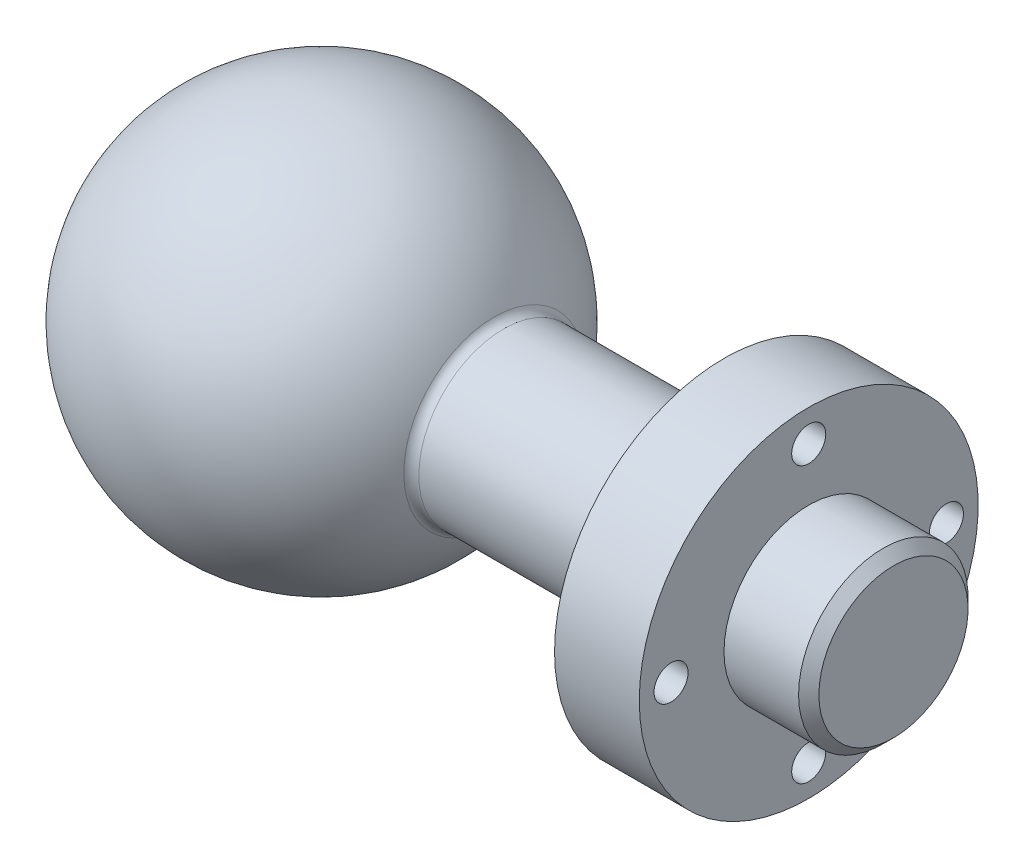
ISO-10303-21;
HEADER;
FILE_DESCRIPTION(('STEP AP214'),'2;1');
FILE_NAME('part.step','',(''),(''),'','','');
FILE_SCHEMA(('AUTOMOTIVE_DESIGN { 1 0 10303 214 1 1 1 1 }'));
ENDSEC;
DATA;
#1=APPLICATION_CONTEXT('core data for automotive mechanical design processes');
#2=APPLICATION_PROTOCOL_DEFINITION('international standard','automotive_design',2000,#1);
#3=PRODUCT_CONTEXT('',#1,'mechanical');
#4=PRODUCT('Part','Part','',(#3));
#5=PRODUCT_RELATED_PRODUCT_CATEGORY('part','',(#4));
#6=PRODUCT_DEFINITION_FORMATION('','',#4);
#7=PRODUCT_DEFINITION_CONTEXT('part definition',#1,'design');
#8=PRODUCT_DEFINITION('design','',#6,#7);
#9=PRODUCT_DEFINITION_SHAPE('','',#8);
#10=(LENGTH_UNIT() NAMED_UNIT(*) SI_UNIT(.MILLI.,.METRE.));
#11=(NAMED_UNIT(*) PLANE_ANGLE_UNIT() SI_UNIT($,.RADIAN.));
#12=(NAMED_UNIT(*) SI_UNIT($,.STERADIAN.) SOLID_ANGLE_UNIT());
#13=UNCERTAINTY_MEASURE_WITH_UNIT(LENGTH_MEASURE(1.E-05),#10,'distance_accuracy_value','');
#14=(GEOMETRIC_REPRESENTATION_CONTEXT(3) GLOBAL_UNCERTAINTY_ASSIGNED_CONTEXT((#13)) GLOBAL_UNIT_ASSIGNED_CONTEXT((#10,
#11,#12)) REPRESENTATION_CONTEXT('',''));
#15=CARTESIAN_POINT('',(0.,0.,0.));
#16=DIRECTION('',(0.,0.,1.));
#17=DIRECTION('',(1.,0.,0.));
#18=AXIS2_PLACEMENT_3D('',#15,#16,#17);
#19=CARTESIAN_POINT('',(0.,0.,0.));
#20=DIRECTION('',(-1.,0.,0.));
#21=DIRECTION('',(0.,1.,0.));
#22=AXIS2_PLACEMENT_3D('',#19,#20,#21);
#23=SPHERICAL_SURFACE('',#22,29.21);
#24=CARTESIAN_POINT('',(25.8765078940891,0.,0.));
#25=DIRECTION('',(-1.,0.,0.));
#26=DIRECTION('',(0.,0.,1.));
#27=AXIS2_PLACEMENT_3D('',#24,#25,#26);
#28=CIRCLE('',#27,13.5510309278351);
#29=CARTESIAN_POINT('',(25.8765078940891,0.,13.5510309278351));
#30=VERTEX_POINT('',#29);
#31=EDGE_CURVE('E46',#30,#30,#28,.T.);
#32=ORIENTED_EDGE('',*,*,#31,.T.);
#33=EDGE_LOOP('',(#32));
#34=FACE_BOUND('',#33,.T.);
#35=ADVANCED_FACE('F35',(#34),#23,.T.);
#36=CARTESIAN_POINT('',(85.725,12.7,0.));
#37=DIRECTION('',(-1.,0.,0.));
#38=DIRECTION('',(0.,0.,1.));
#39=AXIS2_PLACEMENT_3D('',#36,#37,#38);
#40=PLANE('',#39);
#41=CARTESIAN_POINT('',(85.725,0.,0.));
#42=DIRECTION('',(-1.,0.,0.));
#43=DIRECTION('',(0.,0.,1.));
#44=AXIS2_PLACEMENT_3D('',#41,#42,#43);
#45=CIRCLE('',#44,11.176);
#46=CARTESIAN_POINT('',(85.725,0.,11.176));
#47=VERTEX_POINT('',#46);
#48=EDGE_CURVE('E10',#47,#47,#45,.F.);
#49=ORIENTED_EDGE('',*,*,#48,.T.);
#50=EDGE_LOOP('',(#49));
#51=FACE_BOUND('',#50,.T.);
#52=ADVANCED_FACE('F114',(#51),#40,.F.);
#53=CARTESIAN_POINT('',(-88.99,0.,0.));
#54=DIRECTION('',(-1.,0.,0.));
#55=DIRECTION('',(0.,0.,1.));
#56=AXIS2_PLACEMENT_3D('',#53,#54,#55);
#57=CYLINDRICAL_SURFACE('',#56,12.7);
#58=CARTESIAN_POINT('',(84.201,0.,0.));
#59=DIRECTION('',(-1.,0.,0.));
#60=DIRECTION('',(0.,0.,1.));
#61=AXIS2_PLACEMENT_3D('',#58,#59,#60);
#62=CIRCLE('',#61,12.7);
#63=CARTESIAN_POINT('',(84.201,0.,12.7));
#64=VERTEX_POINT('',#63);
#65=EDGE_CURVE('E42',#64,#64,#62,.T.);
#66=ORIENTED_EDGE('',*,*,#65,.T.);
#67=EDGE_LOOP('',(#66));
#68=FACE_BOUND('',#67,.T.);
#69=CARTESIAN_POINT('',(73.025,0.,0.));
#70=DIRECTION('',(-1.,0.,0.));
#71=DIRECTION('',(0.,0.,1.));
#72=AXIS2_PLACEMENT_3D('',#69,#70,#71);
#73=CIRCLE('',#72,12.7);
#74=CARTESIAN_POINT('',(73.025,0.,12.7));
#75=VERTEX_POINT('',#74);
#76=EDGE_CURVE('E61',#75,#75,#73,.T.);
#77=ORIENTED_EDGE('',*,*,#76,.F.);
#78=EDGE_LOOP('',(#77));
#79=FACE_BOUND('',#78,.T.);
#80=ADVANCED_FACE('F101',(#68,#79),#57,.T.);
#81=CARTESIAN_POINT('',(73.025,25.4,0.));
#82=DIRECTION('',(-1.,0.,0.));
#83=DIRECTION('',(0.,0.,1.));
#84=AXIS2_PLACEMENT_3D('',#81,#82,#83);
#85=PLANE('',#84);
#86=CARTESIAN_POINT('',(73.025,0.,20.6375));
#87=DIRECTION('',(1.,0.,0.));
#88=DIRECTION('',(0.,0.,-1.));
#89=AXIS2_PLACEMENT_3D('',#86,#87,#88);
#90=CIRCLE('',#89,2.55269999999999);
#91=CARTESIAN_POINT('',(73.025,0.,18.0848));
#92=VERTEX_POINT('',#91);
#93=EDGE_CURVE('E91',#92,#92,#90,.T.);
#94=ORIENTED_EDGE('',*,*,#93,.F.);
#95=EDGE_LOOP('',(#94));
#96=FACE_BOUND('',#95,.T.);
#97=CARTESIAN_POINT('',(73.025,20.6375,0.));
#98=DIRECTION('',(1.,0.,0.));
#99=DIRECTION('',(0.,0.,-1.));
#100=AXIS2_PLACEMENT_3D('',#97,#98,#99);
#101=CIRCLE('',#100,2.55269999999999);
#102=CARTESIAN_POINT('',(73.025,20.6375,-2.55269999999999));
#103=VERTEX_POINT('',#102);
#104=EDGE_CURVE('E85',#103,#103,#101,.T.);
#105=ORIENTED_EDGE('',*,*,#104,.F.);
#106=EDGE_LOOP('',(#105));
#107=FACE_BOUND('',#106,.T.);
#108=CARTESIAN_POINT('',(73.025,0.,-20.6375));
#109=DIRECTION('',(1.,0.,0.));
#110=DIRECTION('',(0.,0.,-1.));
#111=AXIS2_PLACEMENT_3D('',#108,#109,#110);
#112=CIRCLE('',#111,2.55269999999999);
#113=CARTESIAN_POINT('',(73.025,0.,-23.1902));
#114=VERTEX_POINT('',#113);
#115=EDGE_CURVE('E79',#114,#114,#112,.T.);
#116=ORIENTED_EDGE('',*,*,#115,.F.);
#117=EDGE_LOOP('',(#116));
#118=FACE_BOUND('',#117,.T.);
#119=CARTESIAN_POINT('',(73.025,-20.6375,0.));
#120=DIRECTION('',(1.,0.,0.));
#121=DIRECTION('',(0.,0.,-1.));
#122=AXIS2_PLACEMENT_3D('',#119,#120,#121);
#123=CIRCLE('',#122,2.55269999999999);
#124=CARTESIAN_POINT('',(73.025,-20.6375,-2.55269999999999));
#125=VERTEX_POINT('',#124);
#126=EDGE_CURVE('E73',#125,#125,#123,.T.);
#127=ORIENTED_EDGE('',*,*,#126,.F.);
#128=EDGE_LOOP('',(#127));
#129=FACE_BOUND('',#128,.T.);
#130=CARTESIAN_POINT('',(73.025,0.,0.));
#131=DIRECTION('',(-1.,0.,0.));
#132=DIRECTION('',(0.,0.,1.));
#133=AXIS2_PLACEMENT_3D('',#130,#131,#132);
#134=CIRCLE('',#133,25.4);
#135=CARTESIAN_POINT('',(73.025,0.,25.4));
#136=VERTEX_POINT('',#135);
#137=EDGE_CURVE('E64',#136,#136,#134,.T.);
#138=ORIENTED_EDGE('',*,*,#137,.F.);
#139=EDGE_LOOP('',(#138));
#140=FACE_BOUND('',#139,.T.);
#141=ORIENTED_EDGE('',*,*,#76,.T.);
#142=EDGE_LOOP('',(#141));
#143=FACE_BOUND('',#142,.T.);
#144=ADVANCED_FACE('F97',(#96,#107,#118,#129,#140,#143),#85,.F.);
#145=CARTESIAN_POINT('',(-88.99,0.,0.));
#146=DIRECTION('',(-1.,0.,0.));
#147=DIRECTION('',(0.,0.,1.));
#148=AXIS2_PLACEMENT_3D('',#145,#146,#147);
#149=CYLINDRICAL_SURFACE('',#148,25.4);
#150=CARTESIAN_POINT('',(60.325,0.,0.));
#151=DIRECTION('',(-1.,0.,0.));
#152=DIRECTION('',(0.,0.,1.));
#153=AXIS2_PLACEMENT_3D('',#150,#151,#152);
#154=CIRCLE('',#153,25.4);
#155=CARTESIAN_POINT('',(60.325,0.,25.4));
#156=VERTEX_POINT('',#155);
#157=EDGE_CURVE('E67',#156,#156,#154,.T.);
#158=ORIENTED_EDGE('',*,*,#157,.F.);
#159=EDGE_LOOP('',(#158));
#160=FACE_BOUND('',#159,.T.);
#161=ORIENTED_EDGE('',*,*,#137,.T.);
#162=EDGE_LOOP('',(#161));
#163=FACE_BOUND('',#162,.T.);
#164=ADVANCED_FACE('F100',(#160,#163),#149,.T.);
#165=CARTESIAN_POINT('',(60.325,12.7,0.));
#166=DIRECTION('',(1.,0.,0.));
#167=DIRECTION('',(0.,0.,-1.));
#168=AXIS2_PLACEMENT_3D('',#165,#166,#167);
#169=PLANE('',#168);
#170=CARTESIAN_POINT('',(60.325,0.,0.));
#171=DIRECTION('',(1.,0.,0.));
#172=DIRECTION('',(0.,0.,-1.));
#173=AXIS2_PLACEMENT_3D('',#170,#171,#172);
#174=CIRCLE('',#173,14.2875);
#175=CARTESIAN_POINT('',(60.325,0.,-14.2875));
#176=VERTEX_POINT('',#175);
#177=EDGE_CURVE('E50',#176,#176,#174,.T.);
#178=ORIENTED_EDGE('',*,*,#177,.T.);
#179=EDGE_LOOP('',(#178));
#180=FACE_BOUND('',#179,.T.);
#181=CARTESIAN_POINT('',(60.325,0.,20.6375));
#182=DIRECTION('',(1.,0.,0.));
#183=DIRECTION('',(0.,0.,-1.));
#184=AXIS2_PLACEMENT_3D('',#181,#182,#183);
#185=CIRCLE('',#184,2.55269999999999);
#186=CARTESIAN_POINT('',(60.325,0.,18.0848));
#187=VERTEX_POINT('',#186);
#188=EDGE_CURVE('E88',#187,#187,#185,.T.);
#189=ORIENTED_EDGE('',*,*,#188,.T.);
#190=EDGE_LOOP('',(#189));
#191=FACE_BOUND('',#190,.T.);
#192=CARTESIAN_POINT('',(60.325,20.6375,0.));
#193=DIRECTION('',(1.,0.,0.));
#194=DIRECTION('',(0.,0.,-1.));
#195=AXIS2_PLACEMENT_3D('',#192,#193,#194);
#196=CIRCLE('',#195,2.55269999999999);
#197=CARTESIAN_POINT('',(60.325,20.6375,-2.55269999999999));
#198=VERTEX_POINT('',#197);
#199=EDGE_CURVE('E82',#198,#198,#196,.T.);
#200=ORIENTED_EDGE('',*,*,#199,.T.);
#201=EDGE_LOOP('',(#200));
#202=FACE_BOUND('',#201,.T.);
#203=CARTESIAN_POINT('',(60.325,0.,-20.6375));
#204=DIRECTION('',(1.,0.,0.));
#205=DIRECTION('',(0.,0.,-1.));
#206=AXIS2_PLACEMENT_3D('',#203,#204,#205);
#207=CIRCLE('',#206,2.55269999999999);
#208=CARTESIAN_POINT('',(60.325,0.,-23.1902));
#209=VERTEX_POINT('',#208);
#210=EDGE_CURVE('E76',#209,#209,#207,.T.);
#211=ORIENTED_EDGE('',*,*,#210,.T.);
#212=EDGE_LOOP('',(#211));
#213=FACE_BOUND('',#212,.T.);
#214=CARTESIAN_POINT('',(60.325,-20.6375,0.));
#215=DIRECTION('',(1.,0.,0.));
#216=DIRECTION('',(0.,0.,-1.));
#217=AXIS2_PLACEMENT_3D('',#214,#215,#216);
#218=CIRCLE('',#217,2.55269999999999);
#219=CARTESIAN_POINT('',(60.325,-20.6375,-2.55269999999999));
#220=VERTEX_POINT('',#219);
#221=EDGE_CURVE('E70',#220,#220,#218,.T.);
#222=ORIENTED_EDGE('',*,*,#221,.T.);
#223=EDGE_LOOP('',(#222));
#224=FACE_BOUND('',#223,.T.);
#225=ORIENTED_EDGE('',*,*,#157,.T.);
#226=EDGE_LOOP('',(#225));
#227=FACE_BOUND('',#226,.T.);
#228=ADVANCED_FACE('F143',(#180,#191,#202,#213,#224,#227),#169,.F.);
#229=CARTESIAN_POINT('',(-88.99,0.,0.));
#230=DIRECTION('',(-1.,0.,0.));
#231=DIRECTION('',(0.,0.,1.));
#232=AXIS2_PLACEMENT_3D('',#229,#230,#231);
#233=CYLINDRICAL_SURFACE('',#232,12.7);
#234=CARTESIAN_POINT('',(58.7375,0.,0.));
#235=DIRECTION('',(1.,0.,0.));
#236=DIRECTION('',(0.,0.,-1.));
#237=AXIS2_PLACEMENT_3D('',#234,#235,#236);
#238=CIRCLE('',#237,12.7);
#239=CARTESIAN_POINT('',(58.7375,0.,-12.7));
#240=VERTEX_POINT('',#239);
#241=EDGE_CURVE('E55',#240,#240,#238,.F.);
#242=ORIENTED_EDGE('',*,*,#241,.T.);
#243=EDGE_LOOP('',(#242));
#244=FACE_BOUND('',#243,.T.);
#245=CARTESIAN_POINT('',(27.2828398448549,0.,0.));
#246=DIRECTION('',(-1.,0.,0.));
#247=DIRECTION('',(0.,0.,1.));
#248=AXIS2_PLACEMENT_3D('',#245,#246,#247);
#249=CIRCLE('',#248,12.7);
#250=CARTESIAN_POINT('',(27.2828398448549,0.,12.7));
#251=VERTEX_POINT('',#250);
#252=EDGE_CURVE('E58',#251,#251,#249,.F.);
#253=ORIENTED_EDGE('',*,*,#252,.T.);
#254=EDGE_LOOP('',(#253));
#255=FACE_BOUND('',#254,.T.);
#256=ADVANCED_FACE('F140',(#244,#255),#233,.T.);
#257=CARTESIAN_POINT('',(73.025,-20.6375,0.));
#258=DIRECTION('',(1.,0.,0.));
#259=DIRECTION('',(0.,0.,-1.));
#260=AXIS2_PLACEMENT_3D('',#257,#258,#259);
#261=CYLINDRICAL_SURFACE('',#260,2.55269999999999);
#262=ORIENTED_EDGE('',*,*,#221,.F.);
#263=EDGE_LOOP('',(#262));
#264=FACE_BOUND('',#263,.T.);
#265=ORIENTED_EDGE('',*,*,#126,.T.);
#266=EDGE_LOOP('',(#265));
#267=FACE_BOUND('',#266,.T.);
#268=ADVANCED_FACE('F142',(#264,#267),#261,.F.);
#269=CARTESIAN_POINT('',(73.025,0.,-20.6375));
#270=DIRECTION('',(1.,0.,0.));
#271=DIRECTION('',(0.,0.,-1.));
#272=AXIS2_PLACEMENT_3D('',#269,#270,#271);
#273=CYLINDRICAL_SURFACE('',#272,2.55269999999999);
#274=ORIENTED_EDGE('',*,*,#210,.F.);
#275=EDGE_LOOP('',(#274));
#276=FACE_BOUND('',#275,.T.);
#277=ORIENTED_EDGE('',*,*,#115,.T.);
#278=EDGE_LOOP('',(#277));
#279=FACE_BOUND('',#278,.T.);
#280=ADVANCED_FACE('F150',(#276,#279),#273,.F.);
#281=CARTESIAN_POINT('',(73.025,20.6375,0.));
#282=DIRECTION('',(1.,0.,0.));
#283=DIRECTION('',(0.,0.,-1.));
#284=AXIS2_PLACEMENT_3D('',#281,#282,#283);
#285=CYLINDRICAL_SURFACE('',#284,2.55269999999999);
#286=ORIENTED_EDGE('',*,*,#199,.F.);
#287=EDGE_LOOP('',(#286));
#288=FACE_BOUND('',#287,.T.);
#289=ORIENTED_EDGE('',*,*,#104,.T.);
#290=EDGE_LOOP('',(#289));
#291=FACE_BOUND('',#290,.T.);
#292=ADVANCED_FACE('F228',(#288,#291),#285,.F.);
#293=CARTESIAN_POINT('',(73.025,0.,20.6375));
#294=DIRECTION('',(1.,0.,0.));
#295=DIRECTION('',(0.,0.,-1.));
#296=AXIS2_PLACEMENT_3D('',#293,#294,#295);
#297=CYLINDRICAL_SURFACE('',#296,2.55269999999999);
#298=ORIENTED_EDGE('',*,*,#188,.F.);
#299=EDGE_LOOP('',(#298));
#300=FACE_BOUND('',#299,.T.);
#301=ORIENTED_EDGE('',*,*,#93,.T.);
#302=EDGE_LOOP('',(#301));
#303=FACE_BOUND('',#302,.T.);
#304=ADVANCED_FACE('F95',(#300,#303),#297,.F.);
#305=CARTESIAN_POINT('',(58.7375,0.,0.));
#306=DIRECTION('',(1.,0.,0.));
#307=DIRECTION('',(0.,0.,-1.));
#308=AXIS2_PLACEMENT_3D('',#305,#306,#307);
#309=TOROIDAL_SURFACE('',#308,14.2875,1.5875);
#310=ORIENTED_EDGE('',*,*,#177,.F.);
#311=EDGE_LOOP('',(#310));
#312=FACE_BOUND('',#311,.T.);
#313=ORIENTED_EDGE('',*,*,#241,.F.);
#314=EDGE_LOOP('',(#313));
#315=FACE_BOUND('',#314,.T.);
#316=ADVANCED_FACE('F126',(#312,#315),#309,.F.);
#317=CARTESIAN_POINT('',(27.2828398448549,0.,0.));
#318=DIRECTION('',(-1.,0.,0.));
#319=DIRECTION('',(0.,0.,1.));
#320=AXIS2_PLACEMENT_3D('',#317,#318,#319);
#321=TOROIDAL_SURFACE('',#320,14.2875,1.5875);
#322=ORIENTED_EDGE('',*,*,#252,.F.);
#323=EDGE_LOOP('',(#322));
#324=FACE_BOUND('',#323,.T.);
#325=ORIENTED_EDGE('',*,*,#31,.F.);
#326=EDGE_LOOP('',(#325));
#327=FACE_BOUND('',#326,.T.);
#328=ADVANCED_FACE('F128',(#324,#327),#321,.F.);
#329=CARTESIAN_POINT('',(84.201,0.,0.));
#330=DIRECTION('',(-1.,0.,0.));
#331=DIRECTION('',(0.,0.,1.));
#332=AXIS2_PLACEMENT_3D('',#329,#330,#331);
#333=CONICAL_SURFACE('',#332,12.7,0.785398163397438);
#334=CARTESIAN_POINT('',(85.725,0.,11.176));
#335=CARTESIAN_POINT('',(85.709125,0.,11.191875));
#336=CARTESIAN_POINT('',(85.69325,0.,11.20775));
#337=CARTESIAN_POINT('',(85.6615,0.,11.2395));
#338=CARTESIAN_POINT('',(85.645625,0.,11.255375));
#339=CARTESIAN_POINT('',(85.613875,0.,11.287125));
#340=CARTESIAN_POINT('',(85.598,0.,11.303));
#341=CARTESIAN_POINT('',(85.56625,0.,11.33475));
#342=CARTESIAN_POINT('',(85.550375,0.,11.350625));
#343=CARTESIAN_POINT('',(85.518625,0.,11.382375));
#344=CARTESIAN_POINT('',(85.50275,0.,11.39825));
#345=CARTESIAN_POINT('',(85.471,0.,11.43));
#346=CARTESIAN_POINT('',(85.455125,0.,11.445875));
#347=CARTESIAN_POINT('',(85.423375,0.,11.477625));
#348=CARTESIAN_POINT('',(85.4075,0.,11.4935));
#349=CARTESIAN_POINT('',(85.37575,0.,11.52525));
#350=CARTESIAN_POINT('',(85.359875,0.,11.541125));
#351=CARTESIAN_POINT('',(85.328125,0.,11.572875));
#352=CARTESIAN_POINT('',(85.31225,0.,11.58875));
#353=CARTESIAN_POINT('',(85.2805,0.,11.6205));
#354=CARTESIAN_POINT('',(85.264625,0.,11.636375));
#355=CARTESIAN_POINT('',(85.232875,0.,11.668125));
#356=CARTESIAN_POINT('',(85.217,0.,11.684));
#357=CARTESIAN_POINT('',(85.18525,0.,11.71575));
#358=CARTESIAN_POINT('',(85.169375,0.,11.731625));
#359=CARTESIAN_POINT('',(85.137625,0.,11.763375));
#360=CARTESIAN_POINT('',(85.12175,0.,11.77925));
#361=CARTESIAN_POINT('',(85.09,0.,11.811));
#362=CARTESIAN_POINT('',(85.074125,0.,11.826875));
#363=CARTESIAN_POINT('',(85.042375,0.,11.858625));
#364=CARTESIAN_POINT('',(85.0265,0.,11.8745));
#365=CARTESIAN_POINT('',(84.99475,0.,11.90625));
#366=CARTESIAN_POINT('',(84.978875,0.,11.922125));
#367=CARTESIAN_POINT('',(84.947125,0.,11.953875));
#368=CARTESIAN_POINT('',(84.93125,0.,11.96975));
#369=CARTESIAN_POINT('',(84.8995,0.,12.0015));
#370=CARTESIAN_POINT('',(84.883625,0.,12.017375));
#371=CARTESIAN_POINT('',(84.851875,0.,12.049125));
#372=CARTESIAN_POINT('',(84.836,0.,12.065));
#373=CARTESIAN_POINT('',(84.80425,0.,12.09675));
#374=CARTESIAN_POINT('',(84.788375,0.,12.112625));
#375=CARTESIAN_POINT('',(84.756625,0.,12.144375));
#376=CARTESIAN_POINT('',(84.74075,0.,12.16025));
#377=CARTESIAN_POINT('',(84.709,0.,12.192));
#378=CARTESIAN_POINT('',(84.693125,0.,12.207875));
#379=CARTESIAN_POINT('',(84.661375,0.,12.239625));
#380=CARTESIAN_POINT('',(84.6455,0.,12.2555));
#381=CARTESIAN_POINT('',(84.61375,0.,12.28725));
#382=CARTESIAN_POINT('',(84.597875,0.,12.303125));
#383=CARTESIAN_POINT('',(84.566125,0.,12.334875));
#384=CARTESIAN_POINT('',(84.55025,0.,12.35075));
#385=CARTESIAN_POINT('',(84.5185,0.,12.3825));
#386=CARTESIAN_POINT('',(84.502625,0.,12.398375));
#387=CARTESIAN_POINT('',(84.470875,0.,12.430125));
#388=CARTESIAN_POINT('',(84.455,0.,12.446));
#389=CARTESIAN_POINT('',(84.42325,0.,12.47775));
#390=CARTESIAN_POINT('',(84.407375,0.,12.493625));
#391=CARTESIAN_POINT('',(84.375625,0.,12.525375));
#392=CARTESIAN_POINT('',(84.35975,0.,12.54125));
#393=CARTESIAN_POINT('',(84.328,0.,12.573));
#394=CARTESIAN_POINT('',(84.312125,0.,12.588875));
#395=CARTESIAN_POINT('',(84.280375,0.,12.620625));
#396=CARTESIAN_POINT('',(84.2645,0.,12.6365));
#397=CARTESIAN_POINT('',(84.23275,0.,12.66825));
#398=CARTESIAN_POINT('',(84.216875,0.,12.684125));
#399=CARTESIAN_POINT('',(84.201,0.,12.7));
#400=B_SPLINE_CURVE_WITH_KNOTS('',3,(#334,#335,#336,#337,#338,#339,#340,#341,#342,#343,#344,
#345,#346,#347,#348,#349,#350,#351,#352,#353,#354,#355,#356,#357,#358,#359,#360,#361,#362,#363,
#364,#365,#366,#367,#368,#369,#370,#371,#372,#373,#374,#375,#376,#377,#378,#379,#380,#381,#382,
#383,#384,#385,#386,#387,#388,#389,#390,#391,#392,#393,#394,#395,#396,#397,#398,#399),
.UNSPECIFIED.,.F.,.F.,(4,2,2,2,2,2,2,2,2,2,2,2,2,2,2,2,2,2,2,2,2,2,2,2,2,2,2,2,2,2,2,2,4),(0.,
0.0673519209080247,0.13470384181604,0.202055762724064,0.269407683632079,0.336759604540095,
0.40411152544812,0.471463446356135,0.53881536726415,0.606167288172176,0.67351920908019,
0.740871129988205,0.80822305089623,0.875574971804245,0.94292689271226,1.01027881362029,
1.0776307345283,1.14498265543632,1.21233457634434,1.27968649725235,1.34703841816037,
1.4143903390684,1.48174225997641,1.54909418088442,1.61644610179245,1.68379802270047,
1.75114994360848,1.81850186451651,1.88585378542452,1.95320570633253,2.02055762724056,
2.08790954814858,2.1552614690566),.UNSPECIFIED.);
#401=EDGE_CURVE('BSEAM37',#47,#64,#400,.T.);
#402=ORIENTED_EDGE('',*,*,#48,.F.);
#403=ORIENTED_EDGE('',*,*,#65,.F.);
#404=ORIENTED_EDGE('',*,*,#401,.T.);
#405=ORIENTED_EDGE('',*,*,#401,.F.);
#406=EDGE_LOOP('',(#402,#404,#403,#405));
#407=FACE_BOUND('',#406,.T.);
#408=ADVANCED_FACE('F37',(#407),#333,.T.);
#409=CLOSED_SHELL('',(#35,#52,#80,#144,#164,#228,#256,#268,#280,#292,#304,#316,#328,#408));
#410=MANIFOLD_SOLID_BREP('B2',#409);
#411=ADVANCED_BREP_SHAPE_REPRESENTATION('',(#18,#410),#14);
#412=SHAPE_DEFINITION_REPRESENTATION(#9,#411);
ENDSEC;
END-ISO-10303-21;
